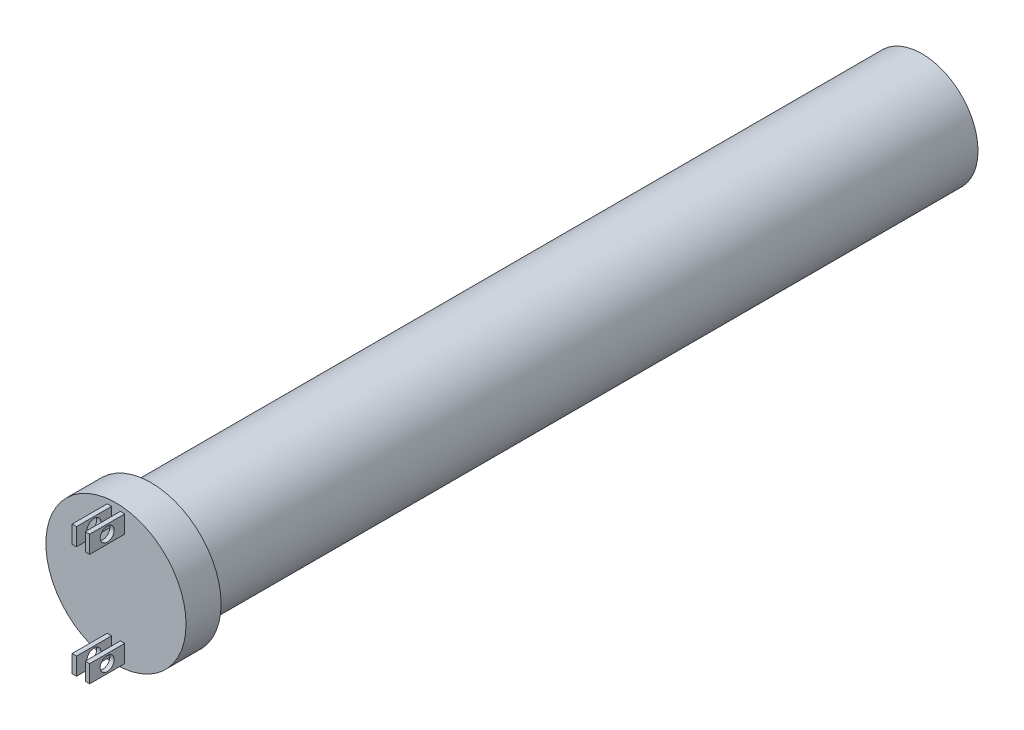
ISO-10303-21;
HEADER;
FILE_DESCRIPTION(('STEP AP214'),'2;1');
FILE_NAME('part.step','',(''),(''),'','','');
FILE_SCHEMA(('AUTOMOTIVE_DESIGN { 1 0 10303 214 1 1 1 1 }'));
ENDSEC;
DATA;
#1=APPLICATION_CONTEXT('core data for automotive mechanical design processes');
#2=APPLICATION_PROTOCOL_DEFINITION('international standard','automotive_design',2000,#1);
#3=PRODUCT_CONTEXT('',#1,'mechanical');
#4=PRODUCT('Part','Part','',(#3));
#5=PRODUCT_RELATED_PRODUCT_CATEGORY('part','',(#4));
#6=PRODUCT_DEFINITION_FORMATION('','',#4);
#7=PRODUCT_DEFINITION_CONTEXT('part definition',#1,'design');
#8=PRODUCT_DEFINITION('design','',#6,#7);
#9=PRODUCT_DEFINITION_SHAPE('','',#8);
#10=(LENGTH_UNIT() NAMED_UNIT(*) SI_UNIT(.MILLI.,.METRE.));
#11=(NAMED_UNIT(*) PLANE_ANGLE_UNIT() SI_UNIT($,.RADIAN.));
#12=(NAMED_UNIT(*) SI_UNIT($,.STERADIAN.) SOLID_ANGLE_UNIT());
#13=UNCERTAINTY_MEASURE_WITH_UNIT(LENGTH_MEASURE(1.E-05),#10,'distance_accuracy_value','');
#14=(GEOMETRIC_REPRESENTATION_CONTEXT(3) GLOBAL_UNCERTAINTY_ASSIGNED_CONTEXT((#13)) GLOBAL_UNIT_ASSIGNED_CONTEXT((#10,
#11,#12)) REPRESENTATION_CONTEXT('',''));
#15=CARTESIAN_POINT('',(0.,0.,0.));
#16=DIRECTION('',(0.,0.,1.));
#17=DIRECTION('',(1.,0.,0.));
#18=AXIS2_PLACEMENT_3D('',#15,#16,#17);
#19=CARTESIAN_POINT('',(0.,17.145,304.8));
#20=DIRECTION('',(0.,1.,0.));
#21=DIRECTION('',(0.,0.,1.));
#22=AXIS2_PLACEMENT_3D('',#19,#20,#21);
#23=PLANE('',#22);
#24=DIRECTION('',(0.,0.,1.));
#25=VECTOR('',#24,1.);
#26=CARTESIAN_POINT('',(1.5875,17.145,304.8));
#27=LINE('',#26,#25);
#28=CARTESIAN_POINT('',(1.5875,17.145,292.1));
#29=VERTEX_POINT('',#28);
#30=CARTESIAN_POINT('',(1.5875,17.145,304.8));
#31=VERTEX_POINT('',#30);
#32=EDGE_CURVE('E59',#29,#31,#27,.T.);
#33=ORIENTED_EDGE('',*,*,#32,.F.);
#34=DIRECTION('',(1.,0.,0.));
#35=VECTOR('',#34,1.);
#36=CARTESIAN_POINT('',(0.,17.145,292.1));
#37=LINE('',#36,#35);
#38=CARTESIAN_POINT('',(3.175,17.145,292.1));
#39=VERTEX_POINT('',#38);
#40=EDGE_CURVE('E203',#29,#39,#37,.T.);
#41=ORIENTED_EDGE('',*,*,#40,.T.);
#42=DIRECTION('',(0.,0.,-1.));
#43=VECTOR('',#42,1.);
#44=CARTESIAN_POINT('',(3.175,17.145,304.8));
#45=LINE('',#44,#43);
#46=CARTESIAN_POINT('',(3.175,17.145,304.8));
#47=VERTEX_POINT('',#46);
#48=EDGE_CURVE('E224',#47,#39,#45,.T.);
#49=ORIENTED_EDGE('',*,*,#48,.F.);
#50=DIRECTION('',(1.,0.,0.));
#51=VECTOR('',#50,1.);
#52=CARTESIAN_POINT('',(0.,17.145,304.8));
#53=LINE('',#52,#51);
#54=EDGE_CURVE('E214',#31,#47,#53,.T.);
#55=ORIENTED_EDGE('',*,*,#54,.F.);
#56=EDGE_LOOP('',(#33,#41,#49,#55));
#57=FACE_BOUND('',#56,.T.);
#58=ADVANCED_FACE('F41',(#57),#23,.F.);
#59=CARTESIAN_POINT('',(0.,23.495,304.8));
#60=DIRECTION('',(0.,1.,0.));
#61=DIRECTION('',(0.,0.,1.));
#62=AXIS2_PLACEMENT_3D('',#59,#60,#61);
#63=PLANE('',#62);
#64=DIRECTION('',(1.,0.,0.));
#65=VECTOR('',#64,1.);
#66=CARTESIAN_POINT('',(0.,23.495,292.1));
#67=LINE('',#66,#65);
#68=CARTESIAN_POINT('',(1.5875,23.495,292.1));
#69=VERTEX_POINT('',#68);
#70=CARTESIAN_POINT('',(3.175,23.495,292.1));
#71=VERTEX_POINT('',#70);
#72=EDGE_CURVE('E207',#69,#71,#67,.T.);
#73=ORIENTED_EDGE('',*,*,#72,.F.);
#74=DIRECTION('',(0.,0.,-1.));
#75=VECTOR('',#74,1.);
#76=CARTESIAN_POINT('',(1.5875,23.495,292.1));
#77=LINE('',#76,#75);
#78=CARTESIAN_POINT('',(1.5875,23.495,304.8));
#79=VERTEX_POINT('',#78);
#80=EDGE_CURVE('E313',#79,#69,#77,.T.);
#81=ORIENTED_EDGE('',*,*,#80,.F.);
#82=DIRECTION('',(1.,0.,0.));
#83=VECTOR('',#82,1.);
#84=CARTESIAN_POINT('',(0.,23.495,304.8));
#85=LINE('',#84,#83);
#86=CARTESIAN_POINT('',(3.175,23.495,304.8));
#87=VERTEX_POINT('',#86);
#88=EDGE_CURVE('E188',#79,#87,#85,.T.);
#89=ORIENTED_EDGE('',*,*,#88,.T.);
#90=DIRECTION('',(0.,0.,-1.));
#91=VECTOR('',#90,1.);
#92=CARTESIAN_POINT('',(3.175,23.495,304.8));
#93=LINE('',#92,#91);
#94=EDGE_CURVE('E220',#87,#71,#93,.T.);
#95=ORIENTED_EDGE('',*,*,#94,.T.);
#96=EDGE_LOOP('',(#73,#81,#89,#95));
#97=FACE_BOUND('',#96,.T.);
#98=ADVANCED_FACE('F387',(#97),#63,.T.);
#99=CARTESIAN_POINT('',(0.,0.,304.8));
#100=DIRECTION('',(0.,0.,1.));
#101=DIRECTION('',(1.,0.,0.));
#102=AXIS2_PLACEMENT_3D('',#99,#100,#101);
#103=PLANE('',#102);
#104=ORIENTED_EDGE('',*,*,#88,.F.);
#105=DIRECTION('',(0.,1.,0.));
#106=VECTOR('',#105,1.);
#107=CARTESIAN_POINT('',(1.5875,23.495,304.8));
#108=LINE('',#107,#106);
#109=EDGE_CURVE('E317',#31,#79,#108,.T.);
#110=ORIENTED_EDGE('',*,*,#109,.F.);
#111=ORIENTED_EDGE('',*,*,#54,.T.);
#112=DIRECTION('',(0.,1.,0.));
#113=VECTOR('',#112,1.);
#114=CARTESIAN_POINT('',(3.175,0.,304.8));
#115=LINE('',#114,#113);
#116=EDGE_CURVE('E194',#47,#87,#115,.T.);
#117=ORIENTED_EDGE('',*,*,#116,.T.);
#118=EDGE_LOOP('',(#104,#110,#111,#117));
#119=FACE_BOUND('',#118,.T.);
#120=ADVANCED_FACE('F371',(#119),#103,.T.);
#121=CARTESIAN_POINT('',(3.175,20.32,298.45));
#122=DIRECTION('',(-1.,0.,0.));
#123=DIRECTION('',(0.,0.,1.));
#124=AXIS2_PLACEMENT_3D('',#121,#122,#123);
#125=CYLINDRICAL_SURFACE('',#124,2.54000000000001);
#126=CARTESIAN_POINT('',(3.175,20.32,298.45));
#127=DIRECTION('',(-1.,0.,0.));
#128=DIRECTION('',(0.,0.,1.));
#129=AXIS2_PLACEMENT_3D('',#126,#127,#128);
#130=CIRCLE('',#129,2.54000000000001);
#131=CARTESIAN_POINT('',(3.175,20.32,300.99));
#132=VERTEX_POINT('',#131);
#133=EDGE_CURVE('E299',#132,#132,#130,.T.);
#134=ORIENTED_EDGE('',*,*,#133,.F.);
#135=EDGE_LOOP('',(#134));
#136=FACE_BOUND('',#135,.T.);
#137=CARTESIAN_POINT('',(1.5875,20.32,298.45));
#138=DIRECTION('',(-1.,0.,0.));
#139=DIRECTION('',(0.,0.,1.));
#140=AXIS2_PLACEMENT_3D('',#137,#138,#139);
#141=CIRCLE('',#140,2.54000000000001);
#142=CARTESIAN_POINT('',(1.5875,20.32,300.99));
#143=VERTEX_POINT('',#142);
#144=EDGE_CURVE('E300',#143,#143,#141,.F.);
#145=ORIENTED_EDGE('',*,*,#144,.F.);
#146=EDGE_LOOP('',(#145));
#147=FACE_BOUND('',#146,.T.);
#148=ADVANCED_FACE('F435',(#136,#147),#125,.F.);
#149=CARTESIAN_POINT('',(0.,-23.495,304.8));
#150=DIRECTION('',(0.,1.,0.));
#151=DIRECTION('',(0.,0.,1.));
#152=AXIS2_PLACEMENT_3D('',#149,#150,#151);
#153=PLANE('',#152);
#154=DIRECTION('',(0.,0.,-1.));
#155=VECTOR('',#154,1.);
#156=CARTESIAN_POINT('',(1.5875,-23.495,292.1));
#157=LINE('',#156,#155);
#158=CARTESIAN_POINT('',(1.5875,-23.495,304.8));
#159=VERTEX_POINT('',#158);
#160=CARTESIAN_POINT('',(1.5875,-23.495,292.1));
#161=VERTEX_POINT('',#160);
#162=EDGE_CURVE('E67',#159,#161,#157,.T.);
#163=ORIENTED_EDGE('',*,*,#162,.T.);
#164=DIRECTION('',(1.,0.,0.));
#165=VECTOR('',#164,1.);
#166=CARTESIAN_POINT('',(0.,-23.495,292.1));
#167=LINE('',#166,#165);
#168=CARTESIAN_POINT('',(3.175,-23.495,292.1));
#169=VERTEX_POINT('',#168);
#170=EDGE_CURVE('E252',#161,#169,#167,.T.);
#171=ORIENTED_EDGE('',*,*,#170,.T.);
#172=DIRECTION('',(0.,0.,-1.));
#173=VECTOR('',#172,1.);
#174=CARTESIAN_POINT('',(3.175,-23.495,304.8));
#175=LINE('',#174,#173);
#176=CARTESIAN_POINT('',(3.175,-23.495,304.8));
#177=VERTEX_POINT('',#176);
#178=EDGE_CURVE('E272',#177,#169,#175,.T.);
#179=ORIENTED_EDGE('',*,*,#178,.F.);
#180=DIRECTION('',(1.,0.,0.));
#181=VECTOR('',#180,1.);
#182=CARTESIAN_POINT('',(0.,-23.495,304.8));
#183=LINE('',#182,#181);
#184=EDGE_CURVE('E233',#159,#177,#183,.T.);
#185=ORIENTED_EDGE('',*,*,#184,.F.);
#186=EDGE_LOOP('',(#163,#171,#179,#185));
#187=FACE_BOUND('',#186,.T.);
#188=ADVANCED_FACE('F472',(#187),#153,.F.);
#189=CARTESIAN_POINT('',(0.,-17.145,304.8));
#190=DIRECTION('',(0.,1.,0.));
#191=DIRECTION('',(0.,0.,1.));
#192=AXIS2_PLACEMENT_3D('',#189,#190,#191);
#193=PLANE('',#192);
#194=DIRECTION('',(1.,0.,0.));
#195=VECTOR('',#194,1.);
#196=CARTESIAN_POINT('',(0.,-17.145,292.1));
#197=LINE('',#196,#195);
#198=CARTESIAN_POINT('',(1.5875,-17.145,292.1));
#199=VERTEX_POINT('',#198);
#200=CARTESIAN_POINT('',(3.175,-17.145,292.1));
#201=VERTEX_POINT('',#200);
#202=EDGE_CURVE('E261',#199,#201,#197,.T.);
#203=ORIENTED_EDGE('',*,*,#202,.F.);
#204=DIRECTION('',(0.,0.,1.));
#205=VECTOR('',#204,1.);
#206=CARTESIAN_POINT('',(1.5875,-17.145,304.8));
#207=LINE('',#206,#205);
#208=CARTESIAN_POINT('',(1.5875,-17.145,304.8));
#209=VERTEX_POINT('',#208);
#210=EDGE_CURVE('E343',#199,#209,#207,.T.);
#211=ORIENTED_EDGE('',*,*,#210,.T.);
#212=DIRECTION('',(1.,0.,0.));
#213=VECTOR('',#212,1.);
#214=CARTESIAN_POINT('',(0.,-17.145,304.8));
#215=LINE('',#214,#213);
#216=CARTESIAN_POINT('',(3.175,-17.145,304.8));
#217=VERTEX_POINT('',#216);
#218=EDGE_CURVE('E243',#209,#217,#215,.T.);
#219=ORIENTED_EDGE('',*,*,#218,.T.);
#220=DIRECTION('',(0.,0.,-1.));
#221=VECTOR('',#220,1.);
#222=CARTESIAN_POINT('',(3.175,-17.145,304.8));
#223=LINE('',#222,#221);
#224=EDGE_CURVE('E268',#217,#201,#223,.T.);
#225=ORIENTED_EDGE('',*,*,#224,.T.);
#226=EDGE_LOOP('',(#203,#211,#219,#225));
#227=FACE_BOUND('',#226,.T.);
#228=ADVANCED_FACE('F515',(#227),#193,.T.);
#229=CARTESIAN_POINT('',(0.,0.,304.8));
#230=DIRECTION('',(0.,0.,1.));
#231=DIRECTION('',(1.,0.,0.));
#232=AXIS2_PLACEMENT_3D('',#229,#230,#231);
#233=PLANE('',#232);
#234=ORIENTED_EDGE('',*,*,#218,.F.);
#235=DIRECTION('',(0.,-1.,0.));
#236=VECTOR('',#235,1.);
#237=CARTESIAN_POINT('',(1.5875,-23.495,304.8));
#238=LINE('',#237,#236);
#239=EDGE_CURVE('E329',#209,#159,#238,.T.);
#240=ORIENTED_EDGE('',*,*,#239,.T.);
#241=ORIENTED_EDGE('',*,*,#184,.T.);
#242=DIRECTION('',(0.,-1.,0.));
#243=VECTOR('',#242,1.);
#244=CARTESIAN_POINT('',(3.175,0.,304.8));
#245=LINE('',#244,#243);
#246=EDGE_CURVE('E239',#217,#177,#245,.T.);
#247=ORIENTED_EDGE('',*,*,#246,.F.);
#248=EDGE_LOOP('',(#234,#240,#241,#247));
#249=FACE_BOUND('',#248,.T.);
#250=ADVANCED_FACE('F416',(#249),#233,.T.);
#251=CARTESIAN_POINT('',(3.175,-20.32,298.45));
#252=DIRECTION('',(-1.,0.,0.));
#253=DIRECTION('',(0.,0.,1.));
#254=AXIS2_PLACEMENT_3D('',#251,#252,#253);
#255=CYLINDRICAL_SURFACE('',#254,2.54000000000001);
#256=CARTESIAN_POINT('',(3.175,-20.32,298.45));
#257=DIRECTION('',(-1.,0.,0.));
#258=DIRECTION('',(0.,0.,1.));
#259=AXIS2_PLACEMENT_3D('',#256,#257,#258);
#260=CIRCLE('',#259,2.54000000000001);
#261=CARTESIAN_POINT('',(3.175,-20.32,300.99));
#262=VERTEX_POINT('',#261);
#263=EDGE_CURVE('E349',#262,#262,#260,.F.);
#264=ORIENTED_EDGE('',*,*,#263,.T.);
#265=EDGE_LOOP('',(#264));
#266=FACE_BOUND('',#265,.T.);
#267=CARTESIAN_POINT('',(1.5875,-20.32,298.45));
#268=DIRECTION('',(-1.,0.,0.));
#269=DIRECTION('',(0.,0.,1.));
#270=AXIS2_PLACEMENT_3D('',#267,#268,#269);
#271=CIRCLE('',#270,2.54000000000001);
#272=CARTESIAN_POINT('',(1.5875,-20.32,300.99));
#273=VERTEX_POINT('',#272);
#274=EDGE_CURVE('E291',#273,#273,#271,.T.);
#275=ORIENTED_EDGE('',*,*,#274,.T.);
#276=EDGE_LOOP('',(#275));
#277=FACE_BOUND('',#276,.T.);
#278=ADVANCED_FACE('F440',(#266,#277),#255,.F.);
#279=CARTESIAN_POINT('',(0.,0.,292.1));
#280=DIRECTION('',(0.,0.,1.));
#281=DIRECTION('',(1.,0.,0.));
#282=AXIS2_PLACEMENT_3D('',#279,#280,#281);
#283=PLANE('',#282);
#284=ORIENTED_EDGE('',*,*,#40,.F.);
#285=DIRECTION('',(0.,-1.,0.));
#286=VECTOR('',#285,1.);
#287=CARTESIAN_POINT('',(1.5875,17.145,292.1));
#288=LINE('',#287,#286);
#289=EDGE_CURVE('E169',#69,#29,#288,.T.);
#290=ORIENTED_EDGE('',*,*,#289,.F.);
#291=ORIENTED_EDGE('',*,*,#72,.T.);
#292=DIRECTION('',(0.,1.,0.));
#293=VECTOR('',#292,1.);
#294=CARTESIAN_POINT('',(3.175,0.,292.1));
#295=LINE('',#294,#293);
#296=EDGE_CURVE('E202',#39,#71,#295,.T.);
#297=ORIENTED_EDGE('',*,*,#296,.F.);
#298=EDGE_LOOP('',(#284,#290,#291,#297));
#299=FACE_BOUND('',#298,.T.);
#300=ORIENTED_EDGE('',*,*,#170,.F.);
#301=DIRECTION('',(0.,1.,0.));
#302=VECTOR('',#301,1.);
#303=CARTESIAN_POINT('',(1.5875,-17.145,292.1));
#304=LINE('',#303,#302);
#305=EDGE_CURVE('E339',#161,#199,#304,.T.);
#306=ORIENTED_EDGE('',*,*,#305,.T.);
#307=ORIENTED_EDGE('',*,*,#202,.T.);
#308=DIRECTION('',(0.,-1.,0.));
#309=VECTOR('',#308,1.);
#310=CARTESIAN_POINT('',(3.175,0.,292.1));
#311=LINE('',#310,#309);
#312=EDGE_CURVE('E257',#201,#169,#311,.T.);
#313=ORIENTED_EDGE('',*,*,#312,.T.);
#314=EDGE_LOOP('',(#300,#306,#307,#313));
#315=FACE_BOUND('',#314,.T.);
#316=CARTESIAN_POINT('',(0.,0.,292.1));
#317=DIRECTION('',(0.,0.,1.));
#318=DIRECTION('',(1.,0.,0.));
#319=AXIS2_PLACEMENT_3D('',#316,#317,#318);
#320=CIRCLE('',#319,25.4);
#321=CARTESIAN_POINT('',(25.4,0.,292.1));
#322=VERTEX_POINT('',#321);
#323=EDGE_CURVE('E281',#322,#322,#320,.T.);
#324=ORIENTED_EDGE('',*,*,#323,.T.);
#325=EDGE_LOOP('',(#324));
#326=FACE_BOUND('',#325,.T.);
#327=CARTESIAN_POINT('',(-3.175,-23.495,292.1));
#328=VERTEX_POINT('',#327);
#329=CARTESIAN_POINT('',(-1.5875,-23.495,292.1));
#330=VERTEX_POINT('',#329);
#331=EDGE_CURVE('E253',#328,#330,#167,.T.);
#332=ORIENTED_EDGE('',*,*,#331,.F.);
#333=DIRECTION('',(0.,-1.,0.));
#334=VECTOR('',#333,1.);
#335=CARTESIAN_POINT('',(-3.175,0.,292.1));
#336=LINE('',#335,#334);
#337=CARTESIAN_POINT('',(-3.175,-17.145,292.1));
#338=VERTEX_POINT('',#337);
#339=EDGE_CURVE('E228',#338,#328,#336,.T.);
#340=ORIENTED_EDGE('',*,*,#339,.F.);
#341=CARTESIAN_POINT('',(-1.5875,-17.145,292.1));
#342=VERTEX_POINT('',#341);
#343=EDGE_CURVE('E234',#338,#342,#197,.T.);
#344=ORIENTED_EDGE('',*,*,#343,.T.);
#345=DIRECTION('',(0.,1.,0.));
#346=VECTOR('',#345,1.);
#347=CARTESIAN_POINT('',(-1.5875,-17.145,292.1));
#348=LINE('',#347,#346);
#349=EDGE_CURVE('E328',#330,#342,#348,.T.);
#350=ORIENTED_EDGE('',*,*,#349,.F.);
#351=EDGE_LOOP('',(#332,#340,#344,#350));
#352=FACE_BOUND('',#351,.T.);
#353=DIRECTION('',(0.,-1.,0.));
#354=VECTOR('',#353,1.);
#355=CARTESIAN_POINT('',(-1.5875,17.145,292.1));
#356=LINE('',#355,#354);
#357=CARTESIAN_POINT('',(-1.5875,23.495,292.1));
#358=VERTEX_POINT('',#357);
#359=CARTESIAN_POINT('',(-1.5875,17.145,292.1));
#360=VERTEX_POINT('',#359);
#361=EDGE_CURVE('E163',#358,#360,#356,.T.);
#362=ORIENTED_EDGE('',*,*,#361,.T.);
#363=CARTESIAN_POINT('',(-3.175,17.145,292.1));
#364=VERTEX_POINT('',#363);
#365=EDGE_CURVE('E198',#364,#360,#37,.T.);
#366=ORIENTED_EDGE('',*,*,#365,.F.);
#367=DIRECTION('',(0.,1.,0.));
#368=VECTOR('',#367,1.);
#369=CARTESIAN_POINT('',(-3.175,0.,292.1));
#370=LINE('',#369,#368);
#371=CARTESIAN_POINT('',(-3.175,23.495,292.1));
#372=VERTEX_POINT('',#371);
#373=EDGE_CURVE('E211',#364,#372,#370,.T.);
#374=ORIENTED_EDGE('',*,*,#373,.T.);
#375=EDGE_CURVE('E208',#372,#358,#67,.T.);
#376=ORIENTED_EDGE('',*,*,#375,.T.);
#377=EDGE_LOOP('',(#362,#366,#374,#376));
#378=FACE_BOUND('',#377,.T.);
#379=ADVANCED_FACE('F381',(#299,#315,#326,#352,#378),#283,.T.);
#380=CARTESIAN_POINT('',(0.,0.,279.4));
#381=DIRECTION('',(0.,0.,-1.));
#382=DIRECTION('',(-1.,0.,0.));
#383=AXIS2_PLACEMENT_3D('',#380,#381,#382);
#384=CYLINDRICAL_SURFACE('',#383,20.32);
#385=CARTESIAN_POINT('',(0.,0.,279.4));
#386=DIRECTION('',(0.,0.,1.));
#387=DIRECTION('',(1.,0.,0.));
#388=AXIS2_PLACEMENT_3D('',#385,#386,#387);
#389=CIRCLE('',#388,20.32);
#390=CARTESIAN_POINT('',(20.32,0.,279.4));
#391=VERTEX_POINT('',#390);
#392=EDGE_CURVE('E11',#391,#391,#389,.T.);
#393=ORIENTED_EDGE('',*,*,#392,.F.);
#394=EDGE_LOOP('',(#393));
#395=FACE_BOUND('',#394,.T.);
#396=CARTESIAN_POINT('',(0.,0.,0.));
#397=DIRECTION('',(0.,0.,1.));
#398=DIRECTION('',(1.,0.,0.));
#399=AXIS2_PLACEMENT_3D('',#396,#397,#398);
#400=CIRCLE('',#399,20.32);
#401=CARTESIAN_POINT('',(20.32,0.,0.));
#402=VERTEX_POINT('',#401);
#403=EDGE_CURVE('E51',#402,#402,#400,.T.);
#404=ORIENTED_EDGE('',*,*,#403,.T.);
#405=EDGE_LOOP('',(#404));
#406=FACE_BOUND('',#405,.T.);
#407=ADVANCED_FACE('F43',(#395,#406),#384,.T.);
#408=CARTESIAN_POINT('',(0.,0.,0.));
#409=DIRECTION('',(0.,0.,1.));
#410=DIRECTION('',(1.,0.,0.));
#411=AXIS2_PLACEMENT_3D('',#408,#409,#410);
#412=PLANE('',#411);
#413=ORIENTED_EDGE('',*,*,#403,.F.);
#414=EDGE_LOOP('',(#413));
#415=FACE_BOUND('',#414,.T.);
#416=ADVANCED_FACE('F481',(#415),#412,.F.);
#417=CARTESIAN_POINT('',(0.,0.,292.1));
#418=DIRECTION('',(0.,0.,-1.));
#419=DIRECTION('',(-1.,0.,0.));
#420=AXIS2_PLACEMENT_3D('',#417,#418,#419);
#421=CYLINDRICAL_SURFACE('',#420,25.4);
#422=ORIENTED_EDGE('',*,*,#323,.F.);
#423=EDGE_LOOP('',(#422));
#424=FACE_BOUND('',#423,.T.);
#425=CARTESIAN_POINT('',(0.,0.,279.4));
#426=DIRECTION('',(0.,0.,1.));
#427=DIRECTION('',(1.,0.,0.));
#428=AXIS2_PLACEMENT_3D('',#425,#426,#427);
#429=CIRCLE('',#428,25.4);
#430=CARTESIAN_POINT('',(25.4,0.,279.4));
#431=VERTEX_POINT('',#430);
#432=EDGE_CURVE('E280',#431,#431,#429,.T.);
#433=ORIENTED_EDGE('',*,*,#432,.T.);
#434=EDGE_LOOP('',(#433));
#435=FACE_BOUND('',#434,.T.);
#436=ADVANCED_FACE('F473',(#424,#435),#421,.T.);
#437=CARTESIAN_POINT('',(0.,0.,279.4));
#438=DIRECTION('',(0.,0.,1.));
#439=DIRECTION('',(1.,0.,0.));
#440=AXIS2_PLACEMENT_3D('',#437,#438,#439);
#441=PLANE('',#440);
#442=ORIENTED_EDGE('',*,*,#392,.T.);
#443=EDGE_LOOP('',(#442));
#444=FACE_BOUND('',#443,.T.);
#445=ORIENTED_EDGE('',*,*,#432,.F.);
#446=EDGE_LOOP('',(#445));
#447=FACE_BOUND('',#446,.T.);
#448=ADVANCED_FACE('F463',(#444,#447),#441,.F.);
#449=CARTESIAN_POINT('',(-3.175,0.,304.8));
#450=DIRECTION('',(1.,0.,0.));
#451=DIRECTION('',(0.,0.,-1.));
#452=AXIS2_PLACEMENT_3D('',#449,#450,#451);
#453=PLANE('',#452);
#454=CARTESIAN_POINT('',(-3.175,-20.32,298.45));
#455=DIRECTION('',(-1.,0.,0.));
#456=DIRECTION('',(0.,0.,1.));
#457=AXIS2_PLACEMENT_3D('',#454,#455,#456);
#458=CIRCLE('',#457,2.54000000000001);
#459=CARTESIAN_POINT('',(-3.175,-20.32,300.99));
#460=VERTEX_POINT('',#459);
#461=EDGE_CURVE('E353',#460,#460,#458,.F.);
#462=ORIENTED_EDGE('',*,*,#461,.T.);
#463=EDGE_LOOP('',(#462));
#464=FACE_BOUND('',#463,.T.);
#465=ORIENTED_EDGE('',*,*,#339,.T.);
#466=DIRECTION('',(0.,0.,-1.));
#467=VECTOR('',#466,1.);
#468=CARTESIAN_POINT('',(-3.175,-23.495,304.8));
#469=LINE('',#468,#467);
#470=CARTESIAN_POINT('',(-3.175,-23.495,304.8));
#471=VERTEX_POINT('',#470);
#472=EDGE_CURVE('E276',#471,#328,#469,.T.);
#473=ORIENTED_EDGE('',*,*,#472,.F.);
#474=DIRECTION('',(0.,-1.,0.));
#475=VECTOR('',#474,1.);
#476=CARTESIAN_POINT('',(-3.175,0.,304.8));
#477=LINE('',#476,#475);
#478=CARTESIAN_POINT('',(-3.175,-17.145,304.8));
#479=VERTEX_POINT('',#478);
#480=EDGE_CURVE('E229',#479,#471,#477,.T.);
#481=ORIENTED_EDGE('',*,*,#480,.F.);
#482=DIRECTION('',(0.,0.,-1.));
#483=VECTOR('',#482,1.);
#484=CARTESIAN_POINT('',(-3.175,-17.145,304.8));
#485=LINE('',#484,#483);
#486=EDGE_CURVE('E248',#479,#338,#485,.T.);
#487=ORIENTED_EDGE('',*,*,#486,.T.);
#488=EDGE_LOOP('',(#465,#473,#481,#487));
#489=FACE_BOUND('',#488,.T.);
#490=ADVANCED_FACE('F461',(#464,#489),#453,.F.);
#491=ORIENTED_EDGE('',*,*,#331,.T.);
#492=DIRECTION('',(0.,0.,-1.));
#493=VECTOR('',#492,1.);
#494=CARTESIAN_POINT('',(-1.5875,-23.495,292.1));
#495=LINE('',#494,#493);
#496=CARTESIAN_POINT('',(-1.5875,-23.495,304.8));
#497=VERTEX_POINT('',#496);
#498=EDGE_CURVE('E324',#497,#330,#495,.T.);
#499=ORIENTED_EDGE('',*,*,#498,.F.);
#500=EDGE_CURVE('E235',#471,#497,#183,.T.);
#501=ORIENTED_EDGE('',*,*,#500,.F.);
#502=ORIENTED_EDGE('',*,*,#472,.T.);
#503=EDGE_LOOP('',(#491,#499,#501,#502));
#504=FACE_BOUND('',#503,.T.);
#505=ADVANCED_FACE('F453',(#504),#153,.F.);
#506=CARTESIAN_POINT('',(3.175,0.,304.8));
#507=DIRECTION('',(1.,0.,0.));
#508=DIRECTION('',(0.,0.,-1.));
#509=AXIS2_PLACEMENT_3D('',#506,#507,#508);
#510=PLANE('',#509);
#511=ORIENTED_EDGE('',*,*,#263,.F.);
#512=EDGE_LOOP('',(#511));
#513=FACE_BOUND('',#512,.T.);
#514=ORIENTED_EDGE('',*,*,#312,.F.);
#515=ORIENTED_EDGE('',*,*,#224,.F.);
#516=ORIENTED_EDGE('',*,*,#246,.T.);
#517=ORIENTED_EDGE('',*,*,#178,.T.);
#518=EDGE_LOOP('',(#514,#515,#516,#517));
#519=FACE_BOUND('',#518,.T.);
#520=ADVANCED_FACE('F470',(#513,#519),#510,.T.);
#521=DIRECTION('',(0.,0.,1.));
#522=VECTOR('',#521,1.);
#523=CARTESIAN_POINT('',(-1.5875,-17.145,304.8));
#524=LINE('',#523,#522);
#525=CARTESIAN_POINT('',(-1.5875,-17.145,304.8));
#526=VERTEX_POINT('',#525);
#527=EDGE_CURVE('E332',#342,#526,#524,.T.);
#528=ORIENTED_EDGE('',*,*,#527,.F.);
#529=ORIENTED_EDGE('',*,*,#343,.F.);
#530=ORIENTED_EDGE('',*,*,#486,.F.);
#531=EDGE_CURVE('E244',#479,#526,#215,.T.);
#532=ORIENTED_EDGE('',*,*,#531,.T.);
#533=EDGE_LOOP('',(#528,#529,#530,#532));
#534=FACE_BOUND('',#533,.T.);
#535=ADVANCED_FACE('F414',(#534),#193,.T.);
#536=DIRECTION('',(0.,-1.,0.));
#537=VECTOR('',#536,1.);
#538=CARTESIAN_POINT('',(-1.5875,-23.495,304.8));
#539=LINE('',#538,#537);
#540=EDGE_CURVE('E296',#526,#497,#539,.T.);
#541=ORIENTED_EDGE('',*,*,#540,.F.);
#542=ORIENTED_EDGE('',*,*,#531,.F.);
#543=ORIENTED_EDGE('',*,*,#480,.T.);
#544=ORIENTED_EDGE('',*,*,#500,.T.);
#545=EDGE_LOOP('',(#541,#542,#543,#544));
#546=FACE_BOUND('',#545,.T.);
#547=ADVANCED_FACE('F407',(#546),#233,.T.);
#548=ORIENTED_EDGE('',*,*,#365,.T.);
#549=DIRECTION('',(0.,0.,1.));
#550=VECTOR('',#549,1.);
#551=CARTESIAN_POINT('',(-1.5875,17.145,304.8));
#552=LINE('',#551,#550);
#553=CARTESIAN_POINT('',(-1.5875,17.145,304.8));
#554=VERTEX_POINT('',#553);
#555=EDGE_CURVE('E181',#360,#554,#552,.T.);
#556=ORIENTED_EDGE('',*,*,#555,.T.);
#557=CARTESIAN_POINT('',(-3.175,17.145,304.8));
#558=VERTEX_POINT('',#557);
#559=EDGE_CURVE('E179',#558,#554,#53,.T.);
#560=ORIENTED_EDGE('',*,*,#559,.F.);
#561=DIRECTION('',(0.,0.,-1.));
#562=VECTOR('',#561,1.);
#563=CARTESIAN_POINT('',(-3.175,17.145,304.8));
#564=LINE('',#563,#562);
#565=EDGE_CURVE('E192',#558,#364,#564,.T.);
#566=ORIENTED_EDGE('',*,*,#565,.T.);
#567=EDGE_LOOP('',(#548,#556,#560,#566));
#568=FACE_BOUND('',#567,.T.);
#569=ADVANCED_FACE('F399',(#568),#23,.F.);
#570=CARTESIAN_POINT('',(3.175,0.,304.8));
#571=DIRECTION('',(-1.,0.,0.));
#572=DIRECTION('',(0.,0.,1.));
#573=AXIS2_PLACEMENT_3D('',#570,#571,#572);
#574=PLANE('',#573);
#575=ORIENTED_EDGE('',*,*,#133,.T.);
#576=EDGE_LOOP('',(#575));
#577=FACE_BOUND('',#576,.T.);
#578=ORIENTED_EDGE('',*,*,#296,.T.);
#579=ORIENTED_EDGE('',*,*,#94,.F.);
#580=ORIENTED_EDGE('',*,*,#116,.F.);
#581=ORIENTED_EDGE('',*,*,#48,.T.);
#582=EDGE_LOOP('',(#578,#579,#580,#581));
#583=FACE_BOUND('',#582,.T.);
#584=ADVANCED_FACE('F376',(#577,#583),#574,.F.);
#585=DIRECTION('',(0.,0.,-1.));
#586=VECTOR('',#585,1.);
#587=CARTESIAN_POINT('',(-1.5875,23.495,292.1));
#588=LINE('',#587,#586);
#589=CARTESIAN_POINT('',(-1.5875,23.495,304.8));
#590=VERTEX_POINT('',#589);
#591=EDGE_CURVE('E156',#590,#358,#588,.T.);
#592=ORIENTED_EDGE('',*,*,#591,.T.);
#593=ORIENTED_EDGE('',*,*,#375,.F.);
#594=DIRECTION('',(0.,0.,-1.));
#595=VECTOR('',#594,1.);
#596=CARTESIAN_POINT('',(-3.175,23.495,304.8));
#597=LINE('',#596,#595);
#598=CARTESIAN_POINT('',(-3.175,23.495,304.8));
#599=VERTEX_POINT('',#598);
#600=EDGE_CURVE('E185',#599,#372,#597,.T.);
#601=ORIENTED_EDGE('',*,*,#600,.F.);
#602=EDGE_CURVE('E176',#599,#590,#85,.T.);
#603=ORIENTED_EDGE('',*,*,#602,.T.);
#604=EDGE_LOOP('',(#592,#593,#601,#603));
#605=FACE_BOUND('',#604,.T.);
#606=ADVANCED_FACE('F183',(#605),#63,.T.);
#607=CARTESIAN_POINT('',(-3.175,0.,304.8));
#608=DIRECTION('',(-1.,0.,0.));
#609=DIRECTION('',(0.,0.,1.));
#610=AXIS2_PLACEMENT_3D('',#607,#608,#609);
#611=PLANE('',#610);
#612=CARTESIAN_POINT('',(-3.175,20.32,298.45));
#613=DIRECTION('',(-1.,0.,0.));
#614=DIRECTION('',(0.,0.,1.));
#615=AXIS2_PLACEMENT_3D('',#612,#613,#614);
#616=CIRCLE('',#615,2.54000000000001);
#617=CARTESIAN_POINT('',(-3.175,20.32,300.99));
#618=VERTEX_POINT('',#617);
#619=EDGE_CURVE('E357',#618,#618,#616,.T.);
#620=ORIENTED_EDGE('',*,*,#619,.F.);
#621=EDGE_LOOP('',(#620));
#622=FACE_BOUND('',#621,.T.);
#623=ORIENTED_EDGE('',*,*,#373,.F.);
#624=ORIENTED_EDGE('',*,*,#565,.F.);
#625=DIRECTION('',(0.,1.,0.));
#626=VECTOR('',#625,1.);
#627=CARTESIAN_POINT('',(-3.175,0.,304.8));
#628=LINE('',#627,#626);
#629=EDGE_CURVE('E187',#558,#599,#628,.T.);
#630=ORIENTED_EDGE('',*,*,#629,.T.);
#631=ORIENTED_EDGE('',*,*,#600,.T.);
#632=EDGE_LOOP('',(#623,#624,#630,#631));
#633=FACE_BOUND('',#632,.T.);
#634=ADVANCED_FACE('F419',(#622,#633),#611,.T.);
#635=DIRECTION('',(0.,1.,0.));
#636=VECTOR('',#635,1.);
#637=CARTESIAN_POINT('',(-1.5875,23.495,304.8));
#638=LINE('',#637,#636);
#639=EDGE_CURVE('E161',#554,#590,#638,.T.);
#640=ORIENTED_EDGE('',*,*,#639,.T.);
#641=ORIENTED_EDGE('',*,*,#602,.F.);
#642=ORIENTED_EDGE('',*,*,#629,.F.);
#643=ORIENTED_EDGE('',*,*,#559,.T.);
#644=EDGE_LOOP('',(#640,#641,#642,#643));
#645=FACE_BOUND('',#644,.T.);
#646=ADVANCED_FACE('F174',(#645),#103,.T.);
#647=CARTESIAN_POINT('',(-1.5875,20.32,298.45));
#648=DIRECTION('',(-1.,0.,0.));
#649=DIRECTION('',(0.,0.,1.));
#650=AXIS2_PLACEMENT_3D('',#647,#648,#649);
#651=CIRCLE('',#650,2.54000000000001);
#652=CARTESIAN_POINT('',(-1.5875,20.32,300.99));
#653=VERTEX_POINT('',#652);
#654=EDGE_CURVE('E45',#653,#653,#651,.F.);
#655=ORIENTED_EDGE('',*,*,#654,.T.);
#656=EDGE_LOOP('',(#655));
#657=FACE_BOUND('',#656,.T.);
#658=ORIENTED_EDGE('',*,*,#619,.T.);
#659=EDGE_LOOP('',(#658));
#660=FACE_BOUND('',#659,.T.);
#661=ADVANCED_FACE('F427',(#657,#660),#125,.F.);
#662=CARTESIAN_POINT('',(-1.5875,-20.32,298.45));
#663=DIRECTION('',(-1.,0.,0.));
#664=DIRECTION('',(0.,0.,1.));
#665=AXIS2_PLACEMENT_3D('',#662,#663,#664);
#666=CIRCLE('',#665,2.54000000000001);
#667=CARTESIAN_POINT('',(-1.5875,-20.32,300.99));
#668=VERTEX_POINT('',#667);
#669=EDGE_CURVE('E295',#668,#668,#666,.T.);
#670=ORIENTED_EDGE('',*,*,#669,.F.);
#671=EDGE_LOOP('',(#670));
#672=FACE_BOUND('',#671,.T.);
#673=ORIENTED_EDGE('',*,*,#461,.F.);
#674=EDGE_LOOP('',(#673));
#675=FACE_BOUND('',#674,.T.);
#676=ADVANCED_FACE('F433',(#672,#675),#255,.F.);
#677=CARTESIAN_POINT('',(-1.5875,0.,0.));
#678=DIRECTION('',(-1.,0.,0.));
#679=DIRECTION('',(0.,0.,1.));
#680=AXIS2_PLACEMENT_3D('',#677,#678,#679);
#681=PLANE('',#680);
#682=ORIENTED_EDGE('',*,*,#669,.T.);
#683=EDGE_LOOP('',(#682));
#684=FACE_BOUND('',#683,.T.);
#685=ORIENTED_EDGE('',*,*,#498,.T.);
#686=ORIENTED_EDGE('',*,*,#349,.T.);
#687=ORIENTED_EDGE('',*,*,#527,.T.);
#688=ORIENTED_EDGE('',*,*,#540,.T.);
#689=EDGE_LOOP('',(#685,#686,#687,#688));
#690=FACE_BOUND('',#689,.T.);
#691=ADVANCED_FACE('F438',(#684,#690),#681,.F.);
#692=CARTESIAN_POINT('',(1.5875,0.,0.));
#693=DIRECTION('',(-1.,0.,0.));
#694=DIRECTION('',(0.,0.,1.));
#695=AXIS2_PLACEMENT_3D('',#692,#693,#694);
#696=PLANE('',#695);
#697=ORIENTED_EDGE('',*,*,#274,.F.);
#698=EDGE_LOOP('',(#697));
#699=FACE_BOUND('',#698,.T.);
#700=ORIENTED_EDGE('',*,*,#162,.F.);
#701=ORIENTED_EDGE('',*,*,#239,.F.);
#702=ORIENTED_EDGE('',*,*,#210,.F.);
#703=ORIENTED_EDGE('',*,*,#305,.F.);
#704=EDGE_LOOP('',(#700,#701,#702,#703));
#705=FACE_BOUND('',#704,.T.);
#706=ADVANCED_FACE('F394',(#699,#705),#696,.T.);
#707=CARTESIAN_POINT('',(-1.5875,0.,0.));
#708=DIRECTION('',(-1.,0.,0.));
#709=DIRECTION('',(0.,0.,1.));
#710=AXIS2_PLACEMENT_3D('',#707,#708,#709);
#711=PLANE('',#710);
#712=ORIENTED_EDGE('',*,*,#591,.F.);
#713=ORIENTED_EDGE('',*,*,#639,.F.);
#714=ORIENTED_EDGE('',*,*,#555,.F.);
#715=ORIENTED_EDGE('',*,*,#361,.F.);
#716=EDGE_LOOP('',(#712,#713,#714,#715));
#717=FACE_BOUND('',#716,.T.);
#718=ORIENTED_EDGE('',*,*,#654,.F.);
#719=EDGE_LOOP('',(#718));
#720=FACE_BOUND('',#719,.T.);
#721=ADVANCED_FACE('F158',(#717,#720),#711,.F.);
#722=CARTESIAN_POINT('',(1.5875,0.,0.));
#723=DIRECTION('',(-1.,0.,0.));
#724=DIRECTION('',(0.,0.,1.));
#725=AXIS2_PLACEMENT_3D('',#722,#723,#724);
#726=PLANE('',#725);
#727=ORIENTED_EDGE('',*,*,#80,.T.);
#728=ORIENTED_EDGE('',*,*,#289,.T.);
#729=ORIENTED_EDGE('',*,*,#32,.T.);
#730=ORIENTED_EDGE('',*,*,#109,.T.);
#731=EDGE_LOOP('',(#727,#728,#729,#730));
#732=FACE_BOUND('',#731,.T.);
#733=ORIENTED_EDGE('',*,*,#144,.T.);
#734=EDGE_LOOP('',(#733));
#735=FACE_BOUND('',#734,.T.);
#736=ADVANCED_FACE('F388',(#732,#735),#726,.T.);
#737=CLOSED_SHELL('',(#58,#98,#120,#148,#188,#228,#250,#278,#379,#407,#416,#436,#448,#490,#505,
#520,#535,#547,#569,#584,#606,#634,#646,#661,#676,#691,#706,#721,#736));
#738=MANIFOLD_SOLID_BREP('B2',#737);
#739=ADVANCED_BREP_SHAPE_REPRESENTATION('',(#18,#738),#14);
#740=SHAPE_DEFINITION_REPRESENTATION(#9,#739);
ENDSEC;
END-ISO-10303-21;
